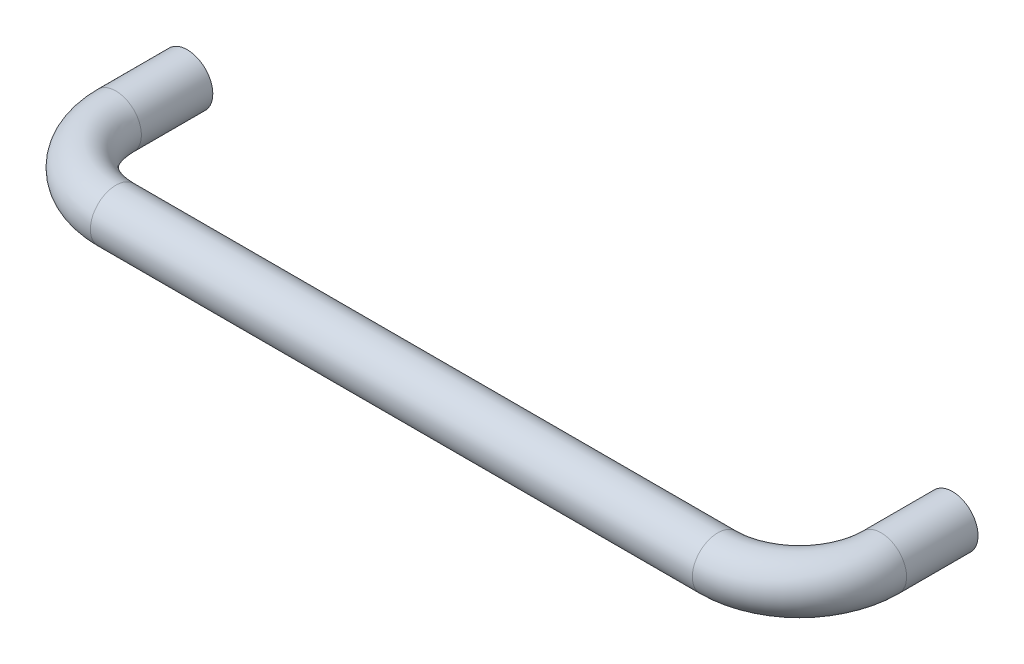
ISO-10303-21;
HEADER;
FILE_DESCRIPTION(('STEP AP214'),'2;1');
FILE_NAME('part.step','',(''),(''),'','','');
FILE_SCHEMA(('AUTOMOTIVE_DESIGN { 1 0 10303 214 1 1 1 1 }'));
ENDSEC;
DATA;
#1=APPLICATION_CONTEXT('core data for automotive mechanical design processes');
#2=APPLICATION_PROTOCOL_DEFINITION('international standard','automotive_design',2000,#1);
#3=PRODUCT_CONTEXT('',#1,'mechanical');
#4=PRODUCT('Part','Part','',(#3));
#5=PRODUCT_RELATED_PRODUCT_CATEGORY('part','',(#4));
#6=PRODUCT_DEFINITION_FORMATION('','',#4);
#7=PRODUCT_DEFINITION_CONTEXT('part definition',#1,'design');
#8=PRODUCT_DEFINITION('design','',#6,#7);
#9=PRODUCT_DEFINITION_SHAPE('','',#8);
#10=(LENGTH_UNIT() NAMED_UNIT(*) SI_UNIT(.MILLI.,.METRE.));
#11=(NAMED_UNIT(*) PLANE_ANGLE_UNIT() SI_UNIT($,.RADIAN.));
#12=(NAMED_UNIT(*) SI_UNIT($,.STERADIAN.) SOLID_ANGLE_UNIT());
#13=UNCERTAINTY_MEASURE_WITH_UNIT(LENGTH_MEASURE(1.E-05),#10,'distance_accuracy_value','');
#14=(GEOMETRIC_REPRESENTATION_CONTEXT(3) GLOBAL_UNCERTAINTY_ASSIGNED_CONTEXT((#13)) GLOBAL_UNIT_ASSIGNED_CONTEXT((#10,
#11,#12)) REPRESENTATION_CONTEXT('',''));
#15=CARTESIAN_POINT('',(0.,0.,0.));
#16=DIRECTION('',(0.,0.,1.));
#17=DIRECTION('',(1.,0.,0.));
#18=AXIS2_PLACEMENT_3D('',#15,#16,#17);
#19=CARTESIAN_POINT('',(299.992502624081,0.,28.));
#20=DIRECTION('',(0.,0.,-1.));
#21=DIRECTION('',(0.,1.,0.));
#22=AXIS2_PLACEMENT_3D('',#19,#20,#21);
#23=CYLINDRICAL_SURFACE('',#22,10.);
#24=CARTESIAN_POINT('',(299.992502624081,0.,28.));
#25=DIRECTION('',(0.,0.,-1.));
#26=DIRECTION('',(0.,-1.,0.));
#27=AXIS2_PLACEMENT_3D('',#24,#25,#26);
#28=CIRCLE('',#27,10.);
#29=CARTESIAN_POINT('',(309.992502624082,0.,28.));
#30=VERTEX_POINT('',#29);
#31=EDGE_CURVE('E18',#30,#30,#28,.T.);
#32=ORIENTED_EDGE('',*,*,#31,.T.);
#33=EDGE_LOOP('',(#32));
#34=FACE_BOUND('',#33,.T.);
#35=CARTESIAN_POINT('',(299.992502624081,0.,0.));
#36=DIRECTION('',(0.,0.,-1.));
#37=DIRECTION('',(0.,-1.,0.));
#38=AXIS2_PLACEMENT_3D('',#35,#36,#37);
#39=CIRCLE('',#38,10.);
#40=CARTESIAN_POINT('',(299.992502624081,-9.99999999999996,0.));
#41=VERTEX_POINT('',#40);
#42=EDGE_CURVE('E8',#41,#41,#39,.T.);
#43=ORIENTED_EDGE('',*,*,#42,.F.);
#44=EDGE_LOOP('',(#43));
#45=FACE_BOUND('',#44,.T.);
#46=ADVANCED_FACE('F12',(#34,#45),#23,.T.);
#47=CARTESIAN_POINT('',(267.992502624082,0.,28.));
#48=DIRECTION('',(0.,1.,0.));
#49=DIRECTION('',(-1.,0.,0.));
#50=AXIS2_PLACEMENT_3D('',#47,#48,#49);
#51=TOROIDAL_SURFACE('',#50,32.,10.);
#52=CARTESIAN_POINT('',(267.992502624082,0.,60.));
#53=DIRECTION('',(1.,0.,0.));
#54=DIRECTION('',(0.,-1.,0.));
#55=AXIS2_PLACEMENT_3D('',#52,#53,#54);
#56=CIRCLE('',#55,10.);
#57=CARTESIAN_POINT('',(267.992502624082,0.,70.));
#58=VERTEX_POINT('',#57);
#59=EDGE_CURVE('E22',#58,#58,#56,.T.);
#60=CARTESIAN_POINT('',(267.992502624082,0.,28.));
#61=DIRECTION('',(0.,1.,0.));
#62=DIRECTION('',(-1.,0.,0.));
#63=AXIS2_PLACEMENT_3D('',#60,#61,#62);
#64=CIRCLE('',#63,42.);
#65=EDGE_CURVE('',#58,#30,#64,.T.);
#66=ORIENTED_EDGE('',*,*,#59,.T.);
#67=ORIENTED_EDGE('',*,*,#31,.F.);
#68=ORIENTED_EDGE('',*,*,#65,.T.);
#69=ORIENTED_EDGE('',*,*,#65,.F.);
#70=EDGE_LOOP('',(#66,#68,#67,#69));
#71=FACE_BOUND('',#70,.T.);
#72=ADVANCED_FACE('F81',(#71),#51,.T.);
#73=CARTESIAN_POINT('',(31.9925026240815,0.,60.));
#74=DIRECTION('',(1.,0.,0.));
#75=DIRECTION('',(0.,0.,1.));
#76=AXIS2_PLACEMENT_3D('',#73,#74,#75);
#77=CYLINDRICAL_SURFACE('',#76,10.);
#78=CARTESIAN_POINT('',(31.9925026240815,0.,60.));
#79=DIRECTION('',(1.,0.,0.));
#80=DIRECTION('',(0.,-1.,0.));
#81=AXIS2_PLACEMENT_3D('',#78,#79,#80);
#82=CIRCLE('',#81,10.);
#83=CARTESIAN_POINT('',(31.9925026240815,0.,70.));
#84=VERTEX_POINT('',#83);
#85=EDGE_CURVE('E26',#84,#84,#82,.T.);
#86=ORIENTED_EDGE('',*,*,#85,.T.);
#87=EDGE_LOOP('',(#86));
#88=FACE_BOUND('',#87,.T.);
#89=ORIENTED_EDGE('',*,*,#59,.F.);
#90=EDGE_LOOP('',(#89));
#91=FACE_BOUND('',#90,.T.);
#92=ADVANCED_FACE('F77',(#88,#91),#77,.T.);
#93=CARTESIAN_POINT('',(31.9925026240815,0.,28.));
#94=DIRECTION('',(0.,1.,0.));
#95=DIRECTION('',(-1.,0.,0.));
#96=AXIS2_PLACEMENT_3D('',#93,#94,#95);
#97=TOROIDAL_SURFACE('',#96,32.,10.);
#98=CARTESIAN_POINT('',(-0.00749737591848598,0.,28.));
#99=DIRECTION('',(0.,0.,1.));
#100=DIRECTION('',(0.,-1.,0.));
#101=AXIS2_PLACEMENT_3D('',#98,#99,#100);
#102=CIRCLE('',#101,10.);
#103=CARTESIAN_POINT('',(-10.0074973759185,0.,28.));
#104=VERTEX_POINT('',#103);
#105=EDGE_CURVE('E31',#104,#104,#102,.T.);
#106=CARTESIAN_POINT('',(31.9925026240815,0.,28.));
#107=DIRECTION('',(0.,1.,0.));
#108=DIRECTION('',(-1.,0.,0.));
#109=AXIS2_PLACEMENT_3D('',#106,#107,#108);
#110=CIRCLE('',#109,42.);
#111=EDGE_CURVE('',#104,#84,#110,.T.);
#112=ORIENTED_EDGE('',*,*,#105,.T.);
#113=ORIENTED_EDGE('',*,*,#85,.F.);
#114=ORIENTED_EDGE('',*,*,#111,.T.);
#115=ORIENTED_EDGE('',*,*,#111,.F.);
#116=EDGE_LOOP('',(#112,#114,#113,#115));
#117=FACE_BOUND('',#116,.T.);
#118=ADVANCED_FACE('F64',(#117),#97,.T.);
#119=CARTESIAN_POINT('',(-0.00749737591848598,0.,28.));
#120=DIRECTION('',(0.,0.,-1.));
#121=DIRECTION('',(0.,1.,0.));
#122=AXIS2_PLACEMENT_3D('',#119,#120,#121);
#123=CYLINDRICAL_SURFACE('',#122,10.);
#124=ORIENTED_EDGE('',*,*,#105,.F.);
#125=EDGE_LOOP('',(#124));
#126=FACE_BOUND('',#125,.T.);
#127=CARTESIAN_POINT('',(-0.00749737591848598,0.,0.));
#128=DIRECTION('',(0.,0.,1.));
#129=DIRECTION('',(0.,-1.,0.));
#130=AXIS2_PLACEMENT_3D('',#127,#128,#129);
#131=CIRCLE('',#130,10.);
#132=CARTESIAN_POINT('',(-0.00749737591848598,-9.99999999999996,0.));
#133=VERTEX_POINT('',#132);
#134=EDGE_CURVE('E34',#133,#133,#131,.T.);
#135=ORIENTED_EDGE('',*,*,#134,.T.);
#136=EDGE_LOOP('',(#135));
#137=FACE_BOUND('',#136,.T.);
#138=ADVANCED_FACE('F62',(#126,#137),#123,.T.);
#139=CARTESIAN_POINT('',(299.992502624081,0.,0.));
#140=DIRECTION('',(0.,0.,-1.));
#141=DIRECTION('',(0.,-1.,0.));
#142=AXIS2_PLACEMENT_3D('',#139,#140,#141);
#143=PLANE('',#142);
#144=CARTESIAN_POINT('',(299.985005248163,0.,0.));
#145=DIRECTION('',(0.,0.,-1.));
#146=DIRECTION('',(0.,-1.,0.));
#147=AXIS2_PLACEMENT_3D('',#144,#145,#146);
#148=CIRCLE('',#147,4.53099737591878);
#149=CARTESIAN_POINT('',(299.985005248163,-4.53099737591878,0.));
#150=VERTEX_POINT('',#149);
#151=EDGE_CURVE('E52',#150,#150,#148,.T.);
#152=ORIENTED_EDGE('',*,*,#151,.F.);
#153=EDGE_LOOP('',(#152));
#154=FACE_BOUND('',#153,.T.);
#155=ORIENTED_EDGE('',*,*,#42,.T.);
#156=EDGE_LOOP('',(#155));
#157=FACE_BOUND('',#156,.T.);
#158=ADVANCED_FACE('F59',(#154,#157),#143,.T.);
#159=CARTESIAN_POINT('',(-0.00749737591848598,0.,0.));
#160=DIRECTION('',(0.,0.,1.));
#161=DIRECTION('',(0.,-1.,0.));
#162=AXIS2_PLACEMENT_3D('',#159,#160,#161);
#163=PLANE('',#162);
#164=CARTESIAN_POINT('',(0.,0.,0.));
#165=DIRECTION('',(0.,0.,1.));
#166=DIRECTION('',(0.,-1.,0.));
#167=AXIS2_PLACEMENT_3D('',#164,#165,#166);
#168=CIRCLE('',#167,4.53099737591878);
#169=CARTESIAN_POINT('',(0.,-4.53099737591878,0.));
#170=VERTEX_POINT('',#169);
#171=EDGE_CURVE('E43',#170,#170,#168,.T.);
#172=ORIENTED_EDGE('',*,*,#171,.T.);
#173=EDGE_LOOP('',(#172));
#174=FACE_BOUND('',#173,.T.);
#175=ORIENTED_EDGE('',*,*,#134,.F.);
#176=EDGE_LOOP('',(#175));
#177=FACE_BOUND('',#176,.T.);
#178=ADVANCED_FACE('F61',(#174,#177),#163,.F.);
#179=CARTESIAN_POINT('',(-4.,0.,15.));
#180=DIRECTION('',(0.,0.,-1.));
#181=DIRECTION('',(0.,1.,0.));
#182=AXIS2_PLACEMENT_3D('',#179,#180,#181);
#183=PLANE('',#182);
#184=CARTESIAN_POINT('',(0.,0.,15.));
#185=DIRECTION('',(0.,0.,1.));
#186=DIRECTION('',(0.,-1.,0.));
#187=AXIS2_PLACEMENT_3D('',#184,#185,#186);
#188=CIRCLE('',#187,4.00000000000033);
#189=CARTESIAN_POINT('',(0.,-4.00000000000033,15.));
#190=VERTEX_POINT('',#189);
#191=EDGE_CURVE('E37',#190,#190,#188,.T.);
#192=ORIENTED_EDGE('',*,*,#191,.F.);
#193=EDGE_LOOP('',(#192));
#194=FACE_BOUND('',#193,.T.);
#195=ADVANCED_FACE('F71',(#194),#183,.T.);
#196=CARTESIAN_POINT('',(0.,0.,28.0149947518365));
#197=DIRECTION('',(0.,0.,1.));
#198=DIRECTION('',(0.,-1.,0.));
#199=AXIS2_PLACEMENT_3D('',#196,#197,#198);
#200=CYLINDRICAL_SURFACE('',#199,4.00000000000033);
#201=ORIENTED_EDGE('',*,*,#191,.T.);
#202=EDGE_LOOP('',(#201));
#203=FACE_BOUND('',#202,.T.);
#204=CARTESIAN_POINT('',(0.,0.,0.530997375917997));
#205=DIRECTION('',(0.,0.,1.));
#206=DIRECTION('',(0.,-1.,0.));
#207=AXIS2_PLACEMENT_3D('',#204,#205,#206);
#208=CIRCLE('',#207,4.00000000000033);
#209=CARTESIAN_POINT('',(0.,-4.00000000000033,0.530997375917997));
#210=VERTEX_POINT('',#209);
#211=EDGE_CURVE('E40',#210,#210,#208,.T.);
#212=ORIENTED_EDGE('',*,*,#211,.F.);
#213=EDGE_LOOP('',(#212));
#214=FACE_BOUND('',#213,.T.);
#215=ADVANCED_FACE('F137',(#203,#214),#200,.F.);
#216=CARTESIAN_POINT('',(0.,0.,0.530997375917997));
#217=DIRECTION('',(0.,0.,-1.));
#218=DIRECTION('',(0.,1.,0.));
#219=AXIS2_PLACEMENT_3D('',#216,#217,#218);
#220=CONICAL_SURFACE('',#219,4.00000000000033,0.7853981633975);
#221=ORIENTED_EDGE('',*,*,#171,.F.);
#222=EDGE_LOOP('',(#221));
#223=FACE_BOUND('',#222,.T.);
#224=ORIENTED_EDGE('',*,*,#211,.T.);
#225=EDGE_LOOP('',(#224));
#226=FACE_BOUND('',#225,.T.);
#227=ADVANCED_FACE('F145',(#223,#226),#220,.F.);
#228=CARTESIAN_POINT('',(303.985005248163,0.,15.));
#229=DIRECTION('',(0.,0.,-1.));
#230=DIRECTION('',(0.,1.,0.));
#231=AXIS2_PLACEMENT_3D('',#228,#229,#230);
#232=PLANE('',#231);
#233=CARTESIAN_POINT('',(299.985005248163,0.,15.));
#234=DIRECTION('',(0.,0.,-1.));
#235=DIRECTION('',(0.,-1.,0.));
#236=AXIS2_PLACEMENT_3D('',#233,#234,#235);
#237=CIRCLE('',#236,4.00000000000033);
#238=CARTESIAN_POINT('',(299.985005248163,-4.00000000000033,15.));
#239=VERTEX_POINT('',#238);
#240=EDGE_CURVE('E46',#239,#239,#237,.T.);
#241=ORIENTED_EDGE('',*,*,#240,.T.);
#242=EDGE_LOOP('',(#241));
#243=FACE_BOUND('',#242,.T.);
#244=ADVANCED_FACE('F154',(#243),#232,.T.);
#245=CARTESIAN_POINT('',(299.985005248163,0.,28.0149947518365));
#246=DIRECTION('',(0.,0.,1.));
#247=DIRECTION('',(0.,-1.,0.));
#248=AXIS2_PLACEMENT_3D('',#245,#246,#247);
#249=CYLINDRICAL_SURFACE('',#248,4.00000000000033);
#250=ORIENTED_EDGE('',*,*,#240,.F.);
#251=EDGE_LOOP('',(#250));
#252=FACE_BOUND('',#251,.T.);
#253=CARTESIAN_POINT('',(299.985005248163,0.,0.530997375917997));
#254=DIRECTION('',(0.,0.,-1.));
#255=DIRECTION('',(0.,-1.,0.));
#256=AXIS2_PLACEMENT_3D('',#253,#254,#255);
#257=CIRCLE('',#256,4.00000000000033);
#258=CARTESIAN_POINT('',(299.985005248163,-4.00000000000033,0.530997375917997));
#259=VERTEX_POINT('',#258);
#260=EDGE_CURVE('E49',#259,#259,#257,.T.);
#261=ORIENTED_EDGE('',*,*,#260,.T.);
#262=EDGE_LOOP('',(#261));
#263=FACE_BOUND('',#262,.T.);
#264=ADVANCED_FACE('F163',(#252,#263),#249,.F.);
#265=CARTESIAN_POINT('',(299.985005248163,0.,0.530997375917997));
#266=DIRECTION('',(0.,0.,-1.));
#267=DIRECTION('',(0.,1.,0.));
#268=AXIS2_PLACEMENT_3D('',#265,#266,#267);
#269=CONICAL_SURFACE('',#268,4.00000000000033,0.7853981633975);
#270=ORIENTED_EDGE('',*,*,#151,.T.);
#271=EDGE_LOOP('',(#270));
#272=FACE_BOUND('',#271,.T.);
#273=ORIENTED_EDGE('',*,*,#260,.F.);
#274=EDGE_LOOP('',(#273));
#275=FACE_BOUND('',#274,.T.);
#276=ADVANCED_FACE('F56',(#272,#275),#269,.F.);
#277=CLOSED_SHELL('',(#46,#72,#92,#118,#138,#158,#178,#195,#215,#227,#244,#264,#276));
#278=MANIFOLD_SOLID_BREP('B1',#277);
#279=ADVANCED_BREP_SHAPE_REPRESENTATION('',(#18,#278),#14);
#280=SHAPE_DEFINITION_REPRESENTATION(#9,#279);
ENDSEC;
END-ISO-10303-21;
